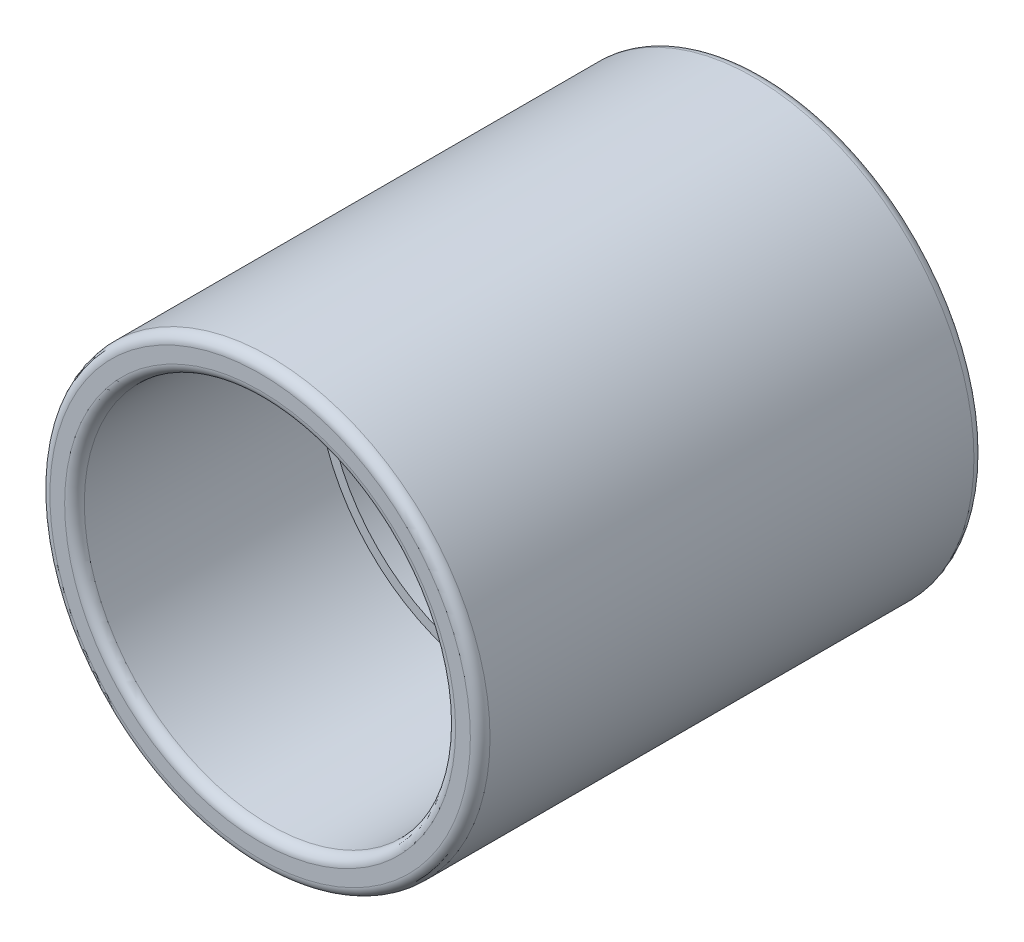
from build123d import *

# Parameters (mm, degrees)
EXTRUDE1_DEPTH      = 32.512
EXTRUDE1_DEPTH_BACK = 32.512
SKETCH1_R           = 28.41625
SKETCH1_R_2         = 23.97125
EXTRUDE2_DEPTH      = 1.27
EXTRUDE2_DEPTH_BACK = 1.27
SKETCH2_R           = 23.97125
SKETCH2_R_2         = 22.70125
FILLET1_R           = 1.27


with BuildPart() as part:
    # Sketch1 → Extrude1 (new, two sides: drawn at the far end of the back side and taken through both)
    with BuildSketch(Plane.XY.offset(-EXTRUDE1_DEPTH_BACK)):
        Circle(SKETCH1_R)
        Circle(SKETCH1_R_2, mode=Mode.SUBTRACT)
    extrude(amount=EXTRUDE1_DEPTH + EXTRUDE1_DEPTH_BACK)

    # Sketch2 → Extrude2 (add, two sides: drawn at the far end of the back side and taken through both)
    with BuildSketch(Plane.XY.offset(-EXTRUDE2_DEPTH_BACK)):
        Circle(SKETCH2_R)
        Circle(SKETCH2_R_2, mode=Mode.SUBTRACT)
    extrude(amount=EXTRUDE2_DEPTH + EXTRUDE2_DEPTH_BACK)

    # Fillet1
    fillet1_edges = [part.edges().sort_by_distance(p)[0] for p in [
        (-28.41625, 0, 32.512),
        (-23.97125, 0, 32.512),
        (-28.41625, 0, -32.512),
        (-23.97125, 0, -32.512),
    ]]
    fillet(fillet1_edges, radius=FILLET1_R)


solid = part.part
